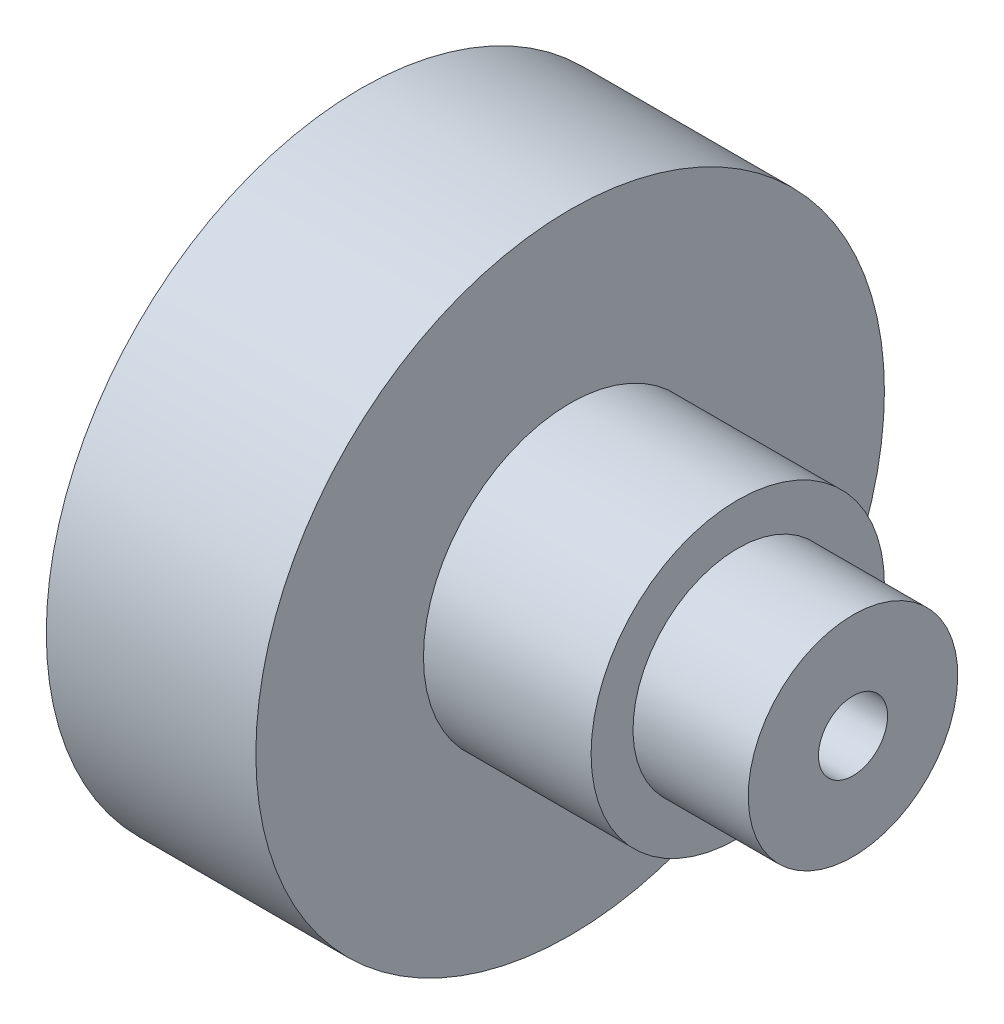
ISO-10303-21;
HEADER;
FILE_DESCRIPTION(('STEP AP214'),'2;1');
FILE_NAME('part.step','',(''),(''),'','','');
FILE_SCHEMA(('AUTOMOTIVE_DESIGN { 1 0 10303 214 1 1 1 1 }'));
ENDSEC;
DATA;
#1=APPLICATION_CONTEXT('core data for automotive mechanical design processes');
#2=APPLICATION_PROTOCOL_DEFINITION('international standard','automotive_design',2000,#1);
#3=PRODUCT_CONTEXT('',#1,'mechanical');
#4=PRODUCT('Part','Part','',(#3));
#5=PRODUCT_RELATED_PRODUCT_CATEGORY('part','',(#4));
#6=PRODUCT_DEFINITION_FORMATION('','',#4);
#7=PRODUCT_DEFINITION_CONTEXT('part definition',#1,'design');
#8=PRODUCT_DEFINITION('design','',#6,#7);
#9=PRODUCT_DEFINITION_SHAPE('','',#8);
#10=(LENGTH_UNIT() NAMED_UNIT(*) SI_UNIT(.MILLI.,.METRE.));
#11=(NAMED_UNIT(*) PLANE_ANGLE_UNIT() SI_UNIT($,.RADIAN.));
#12=(NAMED_UNIT(*) SI_UNIT($,.STERADIAN.) SOLID_ANGLE_UNIT());
#13=UNCERTAINTY_MEASURE_WITH_UNIT(LENGTH_MEASURE(1.E-05),#10,'distance_accuracy_value','');
#14=(GEOMETRIC_REPRESENTATION_CONTEXT(3) GLOBAL_UNCERTAINTY_ASSIGNED_CONTEXT((#13)) GLOBAL_UNIT_ASSIGNED_CONTEXT((#10,
#11,#12)) REPRESENTATION_CONTEXT('',''));
#15=CARTESIAN_POINT('',(0.,0.,0.));
#16=DIRECTION('',(0.,0.,1.));
#17=DIRECTION('',(1.,0.,0.));
#18=AXIS2_PLACEMENT_3D('',#15,#16,#17);
#19=CARTESIAN_POINT('',(0.,0.,0.));
#20=DIRECTION('',(-1.,0.,0.));
#21=DIRECTION('',(0.,-1.,0.));
#22=AXIS2_PLACEMENT_3D('',#19,#20,#21);
#23=PLANE('',#22);
#24=CARTESIAN_POINT('',(0.,0.,0.));
#25=DIRECTION('',(-1.,0.,0.));
#26=DIRECTION('',(0.,-1.,0.));
#27=AXIS2_PLACEMENT_3D('',#24,#25,#26);
#28=CIRCLE('',#27,1.65);
#29=CARTESIAN_POINT('',(0.,-1.65,0.));
#30=VERTEX_POINT('',#29);
#31=EDGE_CURVE('E59',#30,#30,#28,.T.);
#32=ORIENTED_EDGE('',*,*,#31,.F.);
#33=EDGE_LOOP('',(#32));
#34=FACE_BOUND('',#33,.T.);
#35=CARTESIAN_POINT('',(0.,0.,0.));
#36=DIRECTION('',(1.,0.,0.));
#37=DIRECTION('',(0.,1.,0.));
#38=AXIS2_PLACEMENT_3D('',#35,#36,#37);
#39=CIRCLE('',#38,15.);
#40=CARTESIAN_POINT('',(0.,15.,0.));
#41=VERTEX_POINT('',#40);
#42=EDGE_CURVE('E10',#41,#41,#39,.T.);
#43=ORIENTED_EDGE('',*,*,#42,.F.);
#44=EDGE_LOOP('',(#43));
#45=FACE_BOUND('',#44,.T.);
#46=ADVANCED_FACE('F31',(#34,#45),#23,.T.);
#47=CARTESIAN_POINT('',(23.5,0.,0.));
#48=DIRECTION('',(1.,0.,0.));
#49=DIRECTION('',(0.,1.,0.));
#50=AXIS2_PLACEMENT_3D('',#47,#48,#49);
#51=CYLINDRICAL_SURFACE('',#50,15.);
#52=ORIENTED_EDGE('',*,*,#42,.T.);
#53=EDGE_LOOP('',(#52));
#54=FACE_BOUND('',#53,.T.);
#55=CARTESIAN_POINT('',(10.,0.,0.));
#56=DIRECTION('',(1.,0.,0.));
#57=DIRECTION('',(0.,1.,0.));
#58=AXIS2_PLACEMENT_3D('',#55,#56,#57);
#59=CIRCLE('',#58,15.);
#60=CARTESIAN_POINT('',(10.,15.,0.));
#61=VERTEX_POINT('',#60);
#62=EDGE_CURVE('E37',#61,#61,#59,.T.);
#63=ORIENTED_EDGE('',*,*,#62,.F.);
#64=EDGE_LOOP('',(#63));
#65=FACE_BOUND('',#64,.T.);
#66=ADVANCED_FACE('F67',(#54,#65),#51,.T.);
#67=CARTESIAN_POINT('',(10.,15.,0.));
#68=DIRECTION('',(1.,0.,0.));
#69=DIRECTION('',(0.,1.,0.));
#70=AXIS2_PLACEMENT_3D('',#67,#68,#69);
#71=PLANE('',#70);
#72=ORIENTED_EDGE('',*,*,#62,.T.);
#73=EDGE_LOOP('',(#72));
#74=FACE_BOUND('',#73,.T.);
#75=CARTESIAN_POINT('',(10.,0.,0.));
#76=DIRECTION('',(1.,0.,0.));
#77=DIRECTION('',(0.,1.,0.));
#78=AXIS2_PLACEMENT_3D('',#75,#76,#77);
#79=CIRCLE('',#78,7.);
#80=CARTESIAN_POINT('',(10.,7.,0.));
#81=VERTEX_POINT('',#80);
#82=EDGE_CURVE('E41',#81,#81,#79,.T.);
#83=ORIENTED_EDGE('',*,*,#82,.F.);
#84=EDGE_LOOP('',(#83));
#85=FACE_BOUND('',#84,.T.);
#86=ADVANCED_FACE('F71',(#74,#85),#71,.T.);
#87=CARTESIAN_POINT('',(23.5,0.,0.));
#88=DIRECTION('',(1.,0.,0.));
#89=DIRECTION('',(0.,1.,0.));
#90=AXIS2_PLACEMENT_3D('',#87,#88,#89);
#91=CYLINDRICAL_SURFACE('',#90,7.);
#92=ORIENTED_EDGE('',*,*,#82,.T.);
#93=EDGE_LOOP('',(#92));
#94=FACE_BOUND('',#93,.T.);
#95=CARTESIAN_POINT('',(18.,0.,0.));
#96=DIRECTION('',(1.,0.,0.));
#97=DIRECTION('',(0.,1.,0.));
#98=AXIS2_PLACEMENT_3D('',#95,#96,#97);
#99=CIRCLE('',#98,7.);
#100=CARTESIAN_POINT('',(18.,7.,0.));
#101=VERTEX_POINT('',#100);
#102=EDGE_CURVE('E45',#101,#101,#99,.T.);
#103=ORIENTED_EDGE('',*,*,#102,.F.);
#104=EDGE_LOOP('',(#103));
#105=FACE_BOUND('',#104,.T.);
#106=ADVANCED_FACE('F75',(#94,#105),#91,.T.);
#107=CARTESIAN_POINT('',(18.,7.,0.));
#108=DIRECTION('',(1.,0.,0.));
#109=DIRECTION('',(0.,1.,0.));
#110=AXIS2_PLACEMENT_3D('',#107,#108,#109);
#111=PLANE('',#110);
#112=ORIENTED_EDGE('',*,*,#102,.T.);
#113=EDGE_LOOP('',(#112));
#114=FACE_BOUND('',#113,.T.);
#115=CARTESIAN_POINT('',(18.,0.,0.));
#116=DIRECTION('',(1.,0.,0.));
#117=DIRECTION('',(0.,1.,0.));
#118=AXIS2_PLACEMENT_3D('',#115,#116,#117);
#119=CIRCLE('',#118,5.);
#120=CARTESIAN_POINT('',(18.,5.,0.));
#121=VERTEX_POINT('',#120);
#122=EDGE_CURVE('E50',#121,#121,#119,.T.);
#123=ORIENTED_EDGE('',*,*,#122,.F.);
#124=EDGE_LOOP('',(#123));
#125=FACE_BOUND('',#124,.T.);
#126=ADVANCED_FACE('F81',(#114,#125),#111,.T.);
#127=CARTESIAN_POINT('',(23.5,0.,0.));
#128=DIRECTION('',(1.,0.,0.));
#129=DIRECTION('',(0.,1.,0.));
#130=AXIS2_PLACEMENT_3D('',#127,#128,#129);
#131=CYLINDRICAL_SURFACE('',#130,5.);
#132=ORIENTED_EDGE('',*,*,#122,.T.);
#133=EDGE_LOOP('',(#132));
#134=FACE_BOUND('',#133,.T.);
#135=CARTESIAN_POINT('',(23.5,0.,0.));
#136=DIRECTION('',(1.,0.,0.));
#137=DIRECTION('',(0.,1.,0.));
#138=AXIS2_PLACEMENT_3D('',#135,#136,#137);
#139=CIRCLE('',#138,5.);
#140=CARTESIAN_POINT('',(23.5,5.,0.));
#141=VERTEX_POINT('',#140);
#142=EDGE_CURVE('E53',#141,#141,#139,.T.);
#143=ORIENTED_EDGE('',*,*,#142,.F.);
#144=EDGE_LOOP('',(#143));
#145=FACE_BOUND('',#144,.T.);
#146=ADVANCED_FACE('F85',(#134,#145),#131,.T.);
#147=CARTESIAN_POINT('',(23.5,5.,0.));
#148=DIRECTION('',(1.,0.,0.));
#149=DIRECTION('',(0.,1.,0.));
#150=AXIS2_PLACEMENT_3D('',#147,#148,#149);
#151=PLANE('',#150);
#152=CARTESIAN_POINT('',(23.5,0.,0.));
#153=DIRECTION('',(1.,0.,0.));
#154=DIRECTION('',(0.,0.,-1.));
#155=AXIS2_PLACEMENT_3D('',#152,#153,#154);
#156=CIRCLE('',#155,1.64999999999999);
#157=CARTESIAN_POINT('',(23.5,0.,-1.64999999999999));
#158=VERTEX_POINT('',#157);
#159=EDGE_CURVE('E56',#158,#158,#156,.T.);
#160=ORIENTED_EDGE('',*,*,#159,.F.);
#161=EDGE_LOOP('',(#160));
#162=FACE_BOUND('',#161,.T.);
#163=ORIENTED_EDGE('',*,*,#142,.T.);
#164=EDGE_LOOP('',(#163));
#165=FACE_BOUND('',#164,.T.);
#166=ADVANCED_FACE('F89',(#162,#165),#151,.T.);
#167=CARTESIAN_POINT('',(23.5,0.,0.));
#168=DIRECTION('',(1.,0.,0.));
#169=DIRECTION('',(0.,0.,-1.));
#170=AXIS2_PLACEMENT_3D('',#167,#168,#169);
#171=CYLINDRICAL_SURFACE('',#170,1.64999999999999);
#172=ORIENTED_EDGE('',*,*,#159,.T.);
#173=EDGE_LOOP('',(#172));
#174=FACE_BOUND('',#173,.T.);
#175=ORIENTED_EDGE('',*,*,#31,.T.);
#176=EDGE_LOOP('',(#175));
#177=FACE_BOUND('',#176,.T.);
#178=ADVANCED_FACE('F63',(#174,#177),#171,.F.);
#179=CLOSED_SHELL('',(#46,#66,#86,#106,#126,#146,#166,#178));
#180=MANIFOLD_SOLID_BREP('B2',#179);
#181=ADVANCED_BREP_SHAPE_REPRESENTATION('',(#18,#180),#14);
#182=SHAPE_DEFINITION_REPRESENTATION(#9,#181);
ENDSEC;
END-ISO-10303-21;
